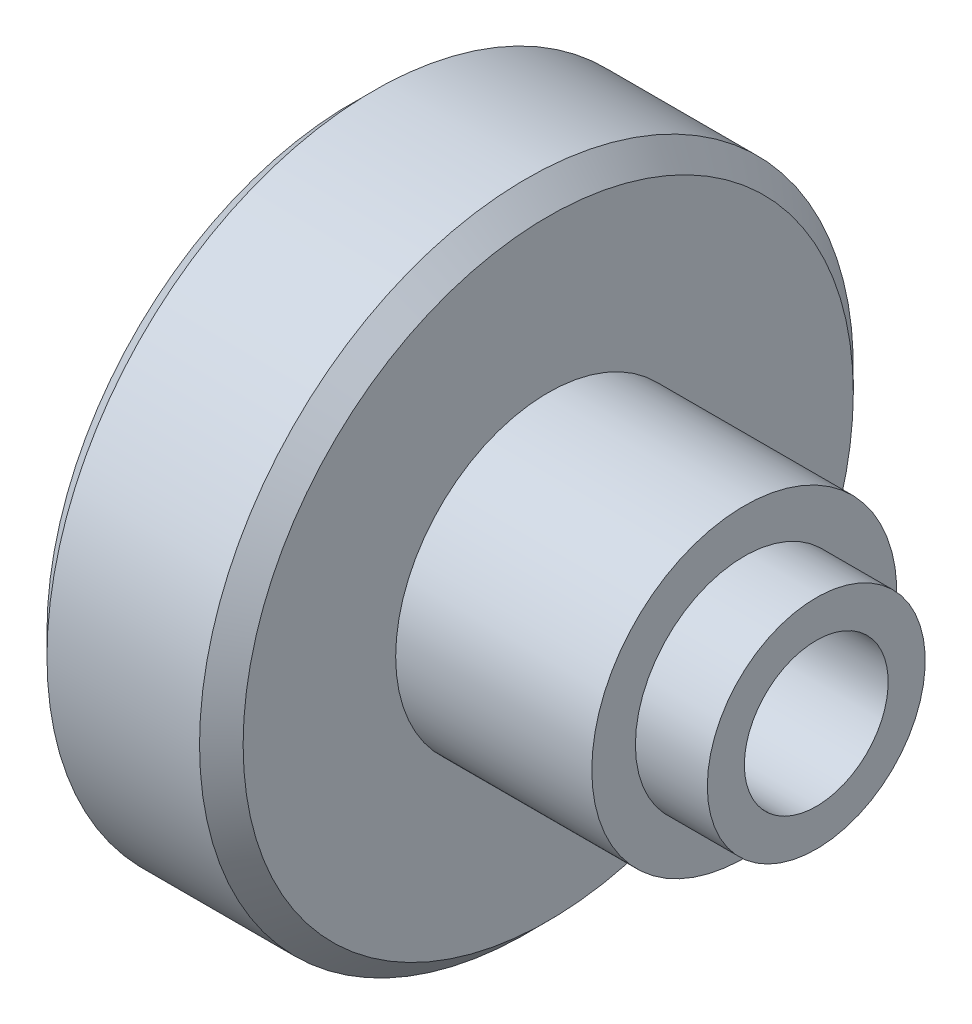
ISO-10303-21;
HEADER;
FILE_DESCRIPTION(('STEP AP214'),'2;1');
FILE_NAME('part.step','',(''),(''),'','','');
FILE_SCHEMA(('AUTOMOTIVE_DESIGN { 1 0 10303 214 1 1 1 1 }'));
ENDSEC;
DATA;
#1=APPLICATION_CONTEXT('core data for automotive mechanical design processes');
#2=APPLICATION_PROTOCOL_DEFINITION('international standard','automotive_design',2000,#1);
#3=PRODUCT_CONTEXT('',#1,'mechanical');
#4=PRODUCT('Part','Part','',(#3));
#5=PRODUCT_RELATED_PRODUCT_CATEGORY('part','',(#4));
#6=PRODUCT_DEFINITION_FORMATION('','',#4);
#7=PRODUCT_DEFINITION_CONTEXT('part definition',#1,'design');
#8=PRODUCT_DEFINITION('design','',#6,#7);
#9=PRODUCT_DEFINITION_SHAPE('','',#8);
#10=(LENGTH_UNIT() NAMED_UNIT(*) SI_UNIT(.MILLI.,.METRE.));
#11=(NAMED_UNIT(*) PLANE_ANGLE_UNIT() SI_UNIT($,.RADIAN.));
#12=(NAMED_UNIT(*) SI_UNIT($,.STERADIAN.) SOLID_ANGLE_UNIT());
#13=UNCERTAINTY_MEASURE_WITH_UNIT(LENGTH_MEASURE(1.E-05),#10,'distance_accuracy_value','');
#14=(GEOMETRIC_REPRESENTATION_CONTEXT(3) GLOBAL_UNCERTAINTY_ASSIGNED_CONTEXT((#13)) GLOBAL_UNIT_ASSIGNED_CONTEXT((#10,
#11,#12)) REPRESENTATION_CONTEXT('',''));
#15=CARTESIAN_POINT('',(0.,0.,0.));
#16=DIRECTION('',(0.,0.,1.));
#17=DIRECTION('',(1.,0.,0.));
#18=AXIS2_PLACEMENT_3D('',#15,#16,#17);
#19=CARTESIAN_POINT('',(9.,15.,0.));
#20=DIRECTION('',(-1.,0.,0.));
#21=DIRECTION('',(0.,0.,1.));
#22=AXIS2_PLACEMENT_3D('',#19,#20,#21);
#23=PLANE('',#22);
#24=CARTESIAN_POINT('',(9.,0.,0.));
#25=DIRECTION('',(-1.,0.,0.));
#26=DIRECTION('',(0.,0.,1.));
#27=AXIS2_PLACEMENT_3D('',#24,#25,#26);
#28=CIRCLE('',#27,14.);
#29=CARTESIAN_POINT('',(9.,0.,14.));
#30=VERTEX_POINT('',#29);
#31=EDGE_CURVE('E35',#30,#30,#28,.F.);
#32=ORIENTED_EDGE('',*,*,#31,.T.);
#33=EDGE_LOOP('',(#32));
#34=FACE_BOUND('',#33,.T.);
#35=CARTESIAN_POINT('',(9.,0.,0.));
#36=DIRECTION('',(-1.,0.,0.));
#37=DIRECTION('',(0.,0.,1.));
#38=AXIS2_PLACEMENT_3D('',#35,#36,#37);
#39=CIRCLE('',#38,7.);
#40=CARTESIAN_POINT('',(9.,0.,7.));
#41=VERTEX_POINT('',#40);
#42=EDGE_CURVE('E66',#41,#41,#39,.T.);
#43=ORIENTED_EDGE('',*,*,#42,.T.);
#44=EDGE_LOOP('',(#43));
#45=FACE_BOUND('',#44,.T.);
#46=ADVANCED_FACE('F28',(#34,#45),#23,.F.);
#47=CARTESIAN_POINT('',(0.,0.,0.));
#48=DIRECTION('',(-1.,0.,0.));
#49=DIRECTION('',(0.,0.,1.));
#50=AXIS2_PLACEMENT_3D('',#47,#48,#49);
#51=CYLINDRICAL_SURFACE('',#50,15.);
#52=CARTESIAN_POINT('',(7.99999999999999,0.,0.));
#53=DIRECTION('',(-1.,0.,0.));
#54=DIRECTION('',(0.,0.,1.));
#55=AXIS2_PLACEMENT_3D('',#52,#53,#54);
#56=CIRCLE('',#55,15.);
#57=CARTESIAN_POINT('',(7.99999999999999,0.,15.));
#58=VERTEX_POINT('',#57);
#59=EDGE_CURVE('E39',#58,#58,#56,.T.);
#60=ORIENTED_EDGE('',*,*,#59,.T.);
#61=EDGE_LOOP('',(#60));
#62=FACE_BOUND('',#61,.T.);
#63=CARTESIAN_POINT('',(1.00000000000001,0.,0.));
#64=DIRECTION('',(1.,0.,0.));
#65=DIRECTION('',(0.,0.,-1.));
#66=AXIS2_PLACEMENT_3D('',#63,#64,#65);
#67=CIRCLE('',#66,15.);
#68=CARTESIAN_POINT('',(1.00000000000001,0.,-15.));
#69=VERTEX_POINT('',#68);
#70=EDGE_CURVE('E43',#69,#69,#67,.T.);
#71=ORIENTED_EDGE('',*,*,#70,.T.);
#72=EDGE_LOOP('',(#71));
#73=FACE_BOUND('',#72,.T.);
#74=ADVANCED_FACE('F110',(#62,#73),#51,.T.);
#75=CARTESIAN_POINT('',(0.,6.3,0.));
#76=DIRECTION('',(1.,0.,0.));
#77=DIRECTION('',(0.,0.,-1.));
#78=AXIS2_PLACEMENT_3D('',#75,#76,#77);
#79=PLANE('',#78);
#80=CARTESIAN_POINT('',(0.,0.,0.));
#81=DIRECTION('',(1.,0.,0.));
#82=DIRECTION('',(0.,0.,-1.));
#83=AXIS2_PLACEMENT_3D('',#80,#81,#82);
#84=CIRCLE('',#83,14.);
#85=CARTESIAN_POINT('',(0.,0.,-14.));
#86=VERTEX_POINT('',#85);
#87=EDGE_CURVE('E10',#86,#86,#84,.F.);
#88=ORIENTED_EDGE('',*,*,#87,.T.);
#89=EDGE_LOOP('',(#88));
#90=FACE_BOUND('',#89,.T.);
#91=CARTESIAN_POINT('',(0.,0.,0.));
#92=DIRECTION('',(-1.,0.,0.));
#93=DIRECTION('',(0.,0.,1.));
#94=AXIS2_PLACEMENT_3D('',#91,#92,#93);
#95=CIRCLE('',#94,6.3);
#96=CARTESIAN_POINT('',(0.,0.,6.3));
#97=VERTEX_POINT('',#96);
#98=EDGE_CURVE('E48',#97,#97,#95,.T.);
#99=ORIENTED_EDGE('',*,*,#98,.F.);
#100=EDGE_LOOP('',(#99));
#101=FACE_BOUND('',#100,.T.);
#102=ADVANCED_FACE('F105',(#90,#101),#79,.F.);
#103=CARTESIAN_POINT('',(0.,0.,0.));
#104=DIRECTION('',(-1.,0.,0.));
#105=DIRECTION('',(0.,0.,1.));
#106=AXIS2_PLACEMENT_3D('',#103,#104,#105);
#107=CONICAL_SURFACE('',#106,6.3,0.785398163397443);
#108=CARTESIAN_POINT('',(3.00000000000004,0.,0.));
#109=DIRECTION('',(-1.,0.,0.));
#110=DIRECTION('',(0.,0.,1.));
#111=AXIS2_PLACEMENT_3D('',#108,#109,#110);
#112=CIRCLE('',#111,3.3);
#113=CARTESIAN_POINT('',(3.00000000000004,0.,3.3));
#114=VERTEX_POINT('',#113);
#115=EDGE_CURVE('E51',#114,#114,#112,.T.);
#116=ORIENTED_EDGE('',*,*,#115,.F.);
#117=EDGE_LOOP('',(#116));
#118=FACE_BOUND('',#117,.T.);
#119=ORIENTED_EDGE('',*,*,#98,.T.);
#120=EDGE_LOOP('',(#119));
#121=FACE_BOUND('',#120,.T.);
#122=ADVANCED_FACE('F99',(#118,#121),#107,.F.);
#123=CARTESIAN_POINT('',(0.,0.,0.));
#124=DIRECTION('',(-1.,0.,0.));
#125=DIRECTION('',(0.,0.,1.));
#126=AXIS2_PLACEMENT_3D('',#123,#124,#125);
#127=CYLINDRICAL_SURFACE('',#126,3.3);
#128=CARTESIAN_POINT('',(21.3,0.,0.));
#129=DIRECTION('',(-1.,0.,0.));
#130=DIRECTION('',(0.,0.,1.));
#131=AXIS2_PLACEMENT_3D('',#128,#129,#130);
#132=CIRCLE('',#131,3.3);
#133=CARTESIAN_POINT('',(21.3,0.,3.3));
#134=VERTEX_POINT('',#133);
#135=EDGE_CURVE('E54',#134,#134,#132,.T.);
#136=ORIENTED_EDGE('',*,*,#135,.F.);
#137=EDGE_LOOP('',(#136));
#138=FACE_BOUND('',#137,.T.);
#139=ORIENTED_EDGE('',*,*,#115,.T.);
#140=EDGE_LOOP('',(#139));
#141=FACE_BOUND('',#140,.T.);
#142=ADVANCED_FACE('F93',(#138,#141),#127,.F.);
#143=CARTESIAN_POINT('',(21.3,5.,0.));
#144=DIRECTION('',(-1.,0.,0.));
#145=DIRECTION('',(0.,0.,1.));
#146=AXIS2_PLACEMENT_3D('',#143,#144,#145);
#147=PLANE('',#146);
#148=CARTESIAN_POINT('',(21.3,0.,0.));
#149=DIRECTION('',(-1.,0.,0.));
#150=DIRECTION('',(0.,0.,1.));
#151=AXIS2_PLACEMENT_3D('',#148,#149,#150);
#152=CIRCLE('',#151,5.);
#153=CARTESIAN_POINT('',(21.3,0.,5.));
#154=VERTEX_POINT('',#153);
#155=EDGE_CURVE('E57',#154,#154,#152,.T.);
#156=ORIENTED_EDGE('',*,*,#155,.F.);
#157=EDGE_LOOP('',(#156));
#158=FACE_BOUND('',#157,.T.);
#159=ORIENTED_EDGE('',*,*,#135,.T.);
#160=EDGE_LOOP('',(#159));
#161=FACE_BOUND('',#160,.T.);
#162=ADVANCED_FACE('F87',(#158,#161),#147,.F.);
#163=CARTESIAN_POINT('',(0.,0.,0.));
#164=DIRECTION('',(-1.,0.,0.));
#165=DIRECTION('',(0.,0.,1.));
#166=AXIS2_PLACEMENT_3D('',#163,#164,#165);
#167=CYLINDRICAL_SURFACE('',#166,5.);
#168=CARTESIAN_POINT('',(18.,0.,0.));
#169=DIRECTION('',(-1.,0.,0.));
#170=DIRECTION('',(0.,0.,1.));
#171=AXIS2_PLACEMENT_3D('',#168,#169,#170);
#172=CIRCLE('',#171,5.);
#173=CARTESIAN_POINT('',(18.,0.,5.));
#174=VERTEX_POINT('',#173);
#175=EDGE_CURVE('E60',#174,#174,#172,.T.);
#176=ORIENTED_EDGE('',*,*,#175,.F.);
#177=EDGE_LOOP('',(#176));
#178=FACE_BOUND('',#177,.T.);
#179=ORIENTED_EDGE('',*,*,#155,.T.);
#180=EDGE_LOOP('',(#179));
#181=FACE_BOUND('',#180,.T.);
#182=ADVANCED_FACE('F81',(#178,#181),#167,.T.);
#183=CARTESIAN_POINT('',(18.,7.,0.));
#184=DIRECTION('',(-1.,0.,0.));
#185=DIRECTION('',(0.,0.,1.));
#186=AXIS2_PLACEMENT_3D('',#183,#184,#185);
#187=PLANE('',#186);
#188=CARTESIAN_POINT('',(18.,0.,0.));
#189=DIRECTION('',(-1.,0.,0.));
#190=DIRECTION('',(0.,0.,1.));
#191=AXIS2_PLACEMENT_3D('',#188,#189,#190);
#192=CIRCLE('',#191,7.);
#193=CARTESIAN_POINT('',(18.,0.,7.));
#194=VERTEX_POINT('',#193);
#195=EDGE_CURVE('E63',#194,#194,#192,.T.);
#196=ORIENTED_EDGE('',*,*,#195,.F.);
#197=EDGE_LOOP('',(#196));
#198=FACE_BOUND('',#197,.T.);
#199=ORIENTED_EDGE('',*,*,#175,.T.);
#200=EDGE_LOOP('',(#199));
#201=FACE_BOUND('',#200,.T.);
#202=ADVANCED_FACE('F75',(#198,#201),#187,.F.);
#203=CARTESIAN_POINT('',(0.,0.,0.));
#204=DIRECTION('',(-1.,0.,0.));
#205=DIRECTION('',(0.,0.,1.));
#206=AXIS2_PLACEMENT_3D('',#203,#204,#205);
#207=CYLINDRICAL_SURFACE('',#206,7.);
#208=ORIENTED_EDGE('',*,*,#42,.F.);
#209=EDGE_LOOP('',(#208));
#210=FACE_BOUND('',#209,.T.);
#211=ORIENTED_EDGE('',*,*,#195,.T.);
#212=EDGE_LOOP('',(#211));
#213=FACE_BOUND('',#212,.T.);
#214=ADVANCED_FACE('F71',(#210,#213),#207,.T.);
#215=CARTESIAN_POINT('',(7.99999999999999,0.,0.));
#216=DIRECTION('',(-1.,0.,0.));
#217=DIRECTION('',(0.,0.,1.));
#218=AXIS2_PLACEMENT_3D('',#215,#216,#217);
#219=CONICAL_SURFACE('',#218,15.,0.78539816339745);
#220=ORIENTED_EDGE('',*,*,#31,.F.);
#221=EDGE_LOOP('',(#220));
#222=FACE_BOUND('',#221,.T.);
#223=ORIENTED_EDGE('',*,*,#59,.F.);
#224=EDGE_LOOP('',(#223));
#225=FACE_BOUND('',#224,.T.);
#226=ADVANCED_FACE('F74',(#222,#225),#219,.T.);
#227=CARTESIAN_POINT('',(0.,0.,0.));
#228=DIRECTION('',(1.,0.,0.));
#229=DIRECTION('',(0.,0.,-1.));
#230=AXIS2_PLACEMENT_3D('',#227,#228,#229);
#231=CONICAL_SURFACE('',#230,14.,0.785398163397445);
#232=ORIENTED_EDGE('',*,*,#70,.F.);
#233=EDGE_LOOP('',(#232));
#234=FACE_BOUND('',#233,.T.);
#235=ORIENTED_EDGE('',*,*,#87,.F.);
#236=EDGE_LOOP('',(#235));
#237=FACE_BOUND('',#236,.T.);
#238=ADVANCED_FACE('F30',(#234,#237),#231,.T.);
#239=CLOSED_SHELL('',(#46,#74,#102,#122,#142,#162,#182,#202,#214,#226,#238));
#240=MANIFOLD_SOLID_BREP('B2',#239);
#241=ADVANCED_BREP_SHAPE_REPRESENTATION('',(#18,#240),#14);
#242=SHAPE_DEFINITION_REPRESENTATION(#9,#241);
ENDSEC;
END-ISO-10303-21;
